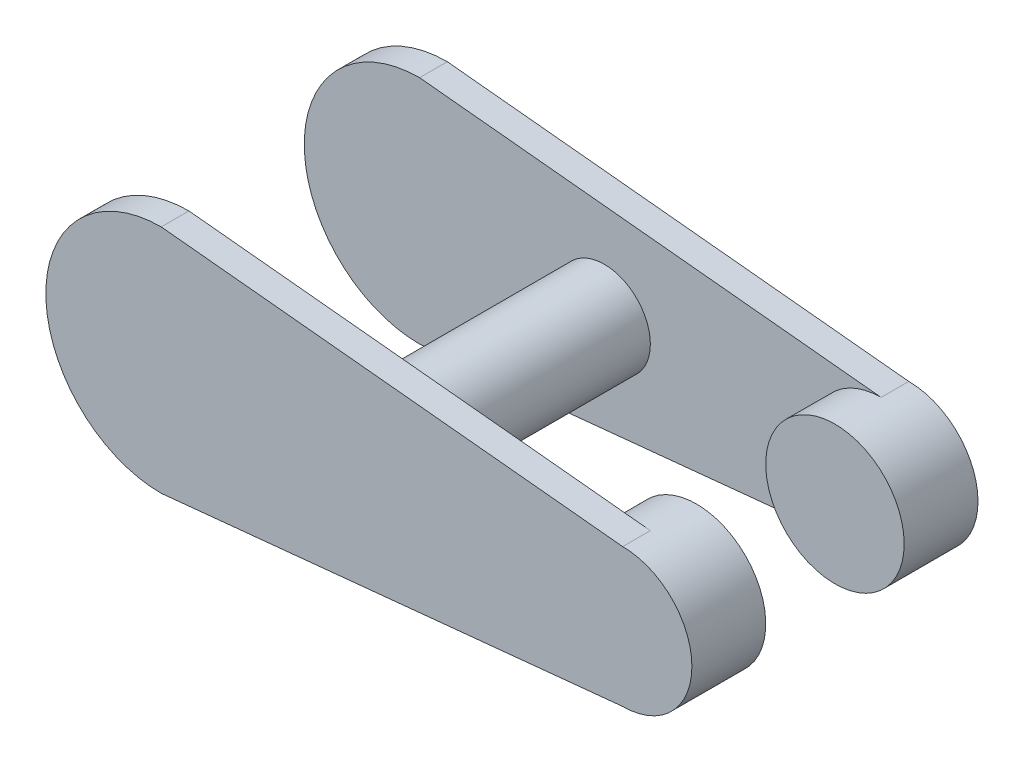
ISO-10303-21;
HEADER;
FILE_DESCRIPTION(('STEP AP214'),'2;1');
FILE_NAME('part.step','',(''),(''),'','','');
FILE_SCHEMA(('AUTOMOTIVE_DESIGN { 1 0 10303 214 1 1 1 1 }'));
ENDSEC;
DATA;
#1=APPLICATION_CONTEXT('core data for automotive mechanical design processes');
#2=APPLICATION_PROTOCOL_DEFINITION('international standard','automotive_design',2000,#1);
#3=PRODUCT_CONTEXT('',#1,'mechanical');
#4=PRODUCT('Part','Part','',(#3));
#5=PRODUCT_RELATED_PRODUCT_CATEGORY('part','',(#4));
#6=PRODUCT_DEFINITION_FORMATION('','',#4);
#7=PRODUCT_DEFINITION_CONTEXT('part definition',#1,'design');
#8=PRODUCT_DEFINITION('design','',#6,#7);
#9=PRODUCT_DEFINITION_SHAPE('','',#8);
#10=(LENGTH_UNIT() NAMED_UNIT(*) SI_UNIT(.MILLI.,.METRE.));
#11=(NAMED_UNIT(*) PLANE_ANGLE_UNIT() SI_UNIT($,.RADIAN.));
#12=(NAMED_UNIT(*) SI_UNIT($,.STERADIAN.) SOLID_ANGLE_UNIT());
#13=UNCERTAINTY_MEASURE_WITH_UNIT(LENGTH_MEASURE(1.E-05),#10,'distance_accuracy_value','');
#14=(GEOMETRIC_REPRESENTATION_CONTEXT(3) GLOBAL_UNCERTAINTY_ASSIGNED_CONTEXT((#13)) GLOBAL_UNIT_ASSIGNED_CONTEXT((#10,
#11,#12)) REPRESENTATION_CONTEXT('',''));
#15=CARTESIAN_POINT('',(0.,0.,0.));
#16=DIRECTION('',(0.,0.,1.));
#17=DIRECTION('',(1.,0.,0.));
#18=AXIS2_PLACEMENT_3D('',#15,#16,#17);
#19=CARTESIAN_POINT('',(1179.73666708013,0.,-125.));
#20=DIRECTION('',(0.,0.,1.));
#21=DIRECTION('',(1.,0.,0.));
#22=AXIS2_PLACEMENT_3D('',#19,#20,#21);
#23=PLANE('',#22);
#24=CARTESIAN_POINT('',(1379.73666708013,0.,-125.));
#25=DIRECTION('',(0.,0.,1.));
#26=DIRECTION('',(1.,0.,0.));
#27=AXIS2_PLACEMENT_3D('',#24,#25,#26);
#28=CIRCLE('',#27,50.);
#29=CARTESIAN_POINT('',(1429.73666708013,0.,-125.));
#30=VERTEX_POINT('',#29);
#31=EDGE_CURVE('E164',#30,#30,#28,.T.);
#32=ORIENTED_EDGE('',*,*,#31,.F.);
#33=EDGE_LOOP('',(#32));
#34=FACE_BOUND('',#33,.T.);
#35=DIRECTION('',(0.995037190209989,0.099503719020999,0.));
#36=VECTOR('',#35,1.);
#37=CARTESIAN_POINT('',(1179.73666708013,-125.,-125.));
#38=LINE('',#37,#36);
#39=CARTESIAN_POINT('',(1179.73666708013,-125.,-125.));
#40=VERTEX_POINT('',#39);
#41=CARTESIAN_POINT('',(1679.73666708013,-75.,-125.));
#42=VERTEX_POINT('',#41);
#43=EDGE_CURVE('E113',#40,#42,#38,.T.);
#44=ORIENTED_EDGE('',*,*,#43,.T.);
#45=CARTESIAN_POINT('',(1679.73666708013,0.,-125.));
#46=DIRECTION('',(0.,0.,1.));
#47=DIRECTION('',(1.,0.,0.));
#48=AXIS2_PLACEMENT_3D('',#45,#46,#47);
#49=CIRCLE('',#48,75.);
#50=CARTESIAN_POINT('',(1679.73666708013,75.,-125.));
#51=VERTEX_POINT('',#50);
#52=EDGE_CURVE('E119',#51,#42,#49,.T.);
#53=ORIENTED_EDGE('',*,*,#52,.F.);
#54=DIRECTION('',(-0.995037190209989,0.099503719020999,0.));
#55=VECTOR('',#54,1.);
#56=CARTESIAN_POINT('',(1179.73666708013,125.,-125.));
#57=LINE('',#56,#55);
#58=CARTESIAN_POINT('',(1179.73666708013,125.,-125.));
#59=VERTEX_POINT('',#58);
#60=EDGE_CURVE('E104',#51,#59,#57,.T.);
#61=ORIENTED_EDGE('',*,*,#60,.T.);
#62=CARTESIAN_POINT('',(1179.73666708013,0.,-125.));
#63=DIRECTION('',(0.,0.,1.));
#64=DIRECTION('',(1.,0.,0.));
#65=AXIS2_PLACEMENT_3D('',#62,#63,#64);
#66=CIRCLE('',#65,125.);
#67=EDGE_CURVE('E167',#59,#40,#66,.T.);
#68=ORIENTED_EDGE('',*,*,#67,.T.);
#69=EDGE_LOOP('',(#44,#53,#61,#68));
#70=FACE_BOUND('',#69,.T.);
#71=ADVANCED_FACE('F37',(#34,#70),#23,.T.);
#72=CARTESIAN_POINT('',(1179.73666708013,0.,125.));
#73=DIRECTION('',(0.,0.,1.));
#74=DIRECTION('',(1.,0.,0.));
#75=AXIS2_PLACEMENT_3D('',#72,#73,#74);
#76=PLANE('',#75);
#77=CARTESIAN_POINT('',(1379.73666708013,0.,125.));
#78=DIRECTION('',(0.,0.,-1.));
#79=DIRECTION('',(-1.,0.,0.));
#80=AXIS2_PLACEMENT_3D('',#77,#78,#79);
#81=CIRCLE('',#80,50.);
#82=CARTESIAN_POINT('',(1329.73666708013,0.,125.));
#83=VERTEX_POINT('',#82);
#84=EDGE_CURVE('E156',#83,#83,#81,.T.);
#85=ORIENTED_EDGE('',*,*,#84,.F.);
#86=EDGE_LOOP('',(#85));
#87=FACE_BOUND('',#86,.T.);
#88=CARTESIAN_POINT('',(1679.73666708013,0.,125.));
#89=DIRECTION('',(0.,0.,1.));
#90=DIRECTION('',(1.,0.,0.));
#91=AXIS2_PLACEMENT_3D('',#88,#89,#90);
#92=CIRCLE('',#91,75.);
#93=CARTESIAN_POINT('',(1679.73666708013,-75.,125.));
#94=VERTEX_POINT('',#93);
#95=CARTESIAN_POINT('',(1679.73666708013,75.,125.));
#96=VERTEX_POINT('',#95);
#97=EDGE_CURVE('E11',#94,#96,#92,.F.);
#98=ORIENTED_EDGE('',*,*,#97,.F.);
#99=DIRECTION('',(0.995037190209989,0.099503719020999,0.));
#100=VECTOR('',#99,1.);
#101=CARTESIAN_POINT('',(1179.73666708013,-125.,125.));
#102=LINE('',#101,#100);
#103=CARTESIAN_POINT('',(1179.73666708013,-125.,125.));
#104=VERTEX_POINT('',#103);
#105=EDGE_CURVE('E136',#104,#94,#102,.T.);
#106=ORIENTED_EDGE('',*,*,#105,.F.);
#107=CARTESIAN_POINT('',(1179.73666708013,0.,125.));
#108=DIRECTION('',(0.,0.,1.));
#109=DIRECTION('',(1.,0.,0.));
#110=AXIS2_PLACEMENT_3D('',#107,#108,#109);
#111=CIRCLE('',#110,125.);
#112=CARTESIAN_POINT('',(1179.73666708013,125.,125.));
#113=VERTEX_POINT('',#112);
#114=EDGE_CURVE('E133',#113,#104,#111,.T.);
#115=ORIENTED_EDGE('',*,*,#114,.F.);
#116=DIRECTION('',(-0.995037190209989,0.099503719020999,0.));
#117=VECTOR('',#116,1.);
#118=CARTESIAN_POINT('',(1179.73666708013,125.,125.));
#119=LINE('',#118,#117);
#120=EDGE_CURVE('E140',#96,#113,#119,.T.);
#121=ORIENTED_EDGE('',*,*,#120,.F.);
#122=EDGE_LOOP('',(#98,#106,#115,#121));
#123=FACE_BOUND('',#122,.T.);
#124=ADVANCED_FACE('F189',(#87,#123),#76,.F.);
#125=CARTESIAN_POINT('',(1179.73666708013,0.,-155.));
#126=DIRECTION('',(0.,0.,1.));
#127=DIRECTION('',(1.,0.,0.));
#128=AXIS2_PLACEMENT_3D('',#125,#126,#127);
#129=CYLINDRICAL_SURFACE('',#128,125.);
#130=ORIENTED_EDGE('',*,*,#67,.F.);
#131=DIRECTION('',(0.,0.,1.));
#132=VECTOR('',#131,1.);
#133=CARTESIAN_POINT('',(1179.73666708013,125.,-155.));
#134=LINE('',#133,#132);
#135=CARTESIAN_POINT('',(1179.73666708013,125.,-155.));
#136=VERTEX_POINT('',#135);
#137=EDGE_CURVE('E46',#136,#59,#134,.T.);
#138=ORIENTED_EDGE('',*,*,#137,.F.);
#139=CARTESIAN_POINT('',(1179.73666708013,0.,-155.));
#140=DIRECTION('',(0.,0.,1.));
#141=DIRECTION('',(1.,0.,0.));
#142=AXIS2_PLACEMENT_3D('',#139,#140,#141);
#143=CIRCLE('',#142,125.);
#144=CARTESIAN_POINT('',(1179.73666708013,-125.,-155.));
#145=VERTEX_POINT('',#144);
#146=EDGE_CURVE('E112',#136,#145,#143,.T.);
#147=ORIENTED_EDGE('',*,*,#146,.T.);
#148=DIRECTION('',(0.,0.,1.));
#149=VECTOR('',#148,1.);
#150=CARTESIAN_POINT('',(1179.73666708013,-125.,-155.));
#151=LINE('',#150,#149);
#152=EDGE_CURVE('E77',#145,#40,#151,.T.);
#153=ORIENTED_EDGE('',*,*,#152,.T.);
#154=EDGE_LOOP('',(#130,#138,#147,#153));
#155=FACE_BOUND('',#154,.T.);
#156=ADVANCED_FACE('F39',(#155),#129,.T.);
#157=CARTESIAN_POINT('',(1179.73666708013,125.,-155.));
#158=DIRECTION('',(0.0995037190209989,0.995037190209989,0.));
#159=DIRECTION('',(-0.995037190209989,0.099503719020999,0.));
#160=AXIS2_PLACEMENT_3D('',#157,#158,#159);
#161=PLANE('',#160);
#162=ORIENTED_EDGE('',*,*,#60,.F.);
#163=DIRECTION('',(0.,0.,1.));
#164=VECTOR('',#163,1.);
#165=CARTESIAN_POINT('',(1679.73666708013,75.,-155.));
#166=LINE('',#165,#164);
#167=CARTESIAN_POINT('',(1679.73666708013,75.,-155.));
#168=VERTEX_POINT('',#167);
#169=EDGE_CURVE('E107',#168,#51,#166,.T.);
#170=ORIENTED_EDGE('',*,*,#169,.F.);
#171=DIRECTION('',(-0.995037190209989,0.099503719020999,0.));
#172=VECTOR('',#171,1.);
#173=CARTESIAN_POINT('',(1179.73666708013,125.,-155.));
#174=LINE('',#173,#172);
#175=EDGE_CURVE('E172',#168,#136,#174,.T.);
#176=ORIENTED_EDGE('',*,*,#175,.T.);
#177=ORIENTED_EDGE('',*,*,#137,.T.);
#178=EDGE_LOOP('',(#162,#170,#176,#177));
#179=FACE_BOUND('',#178,.T.);
#180=ADVANCED_FACE('F106',(#179),#161,.T.);
#181=CARTESIAN_POINT('',(1679.73666708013,0.,-155.));
#182=DIRECTION('',(0.,0.,1.));
#183=DIRECTION('',(1.,0.,0.));
#184=AXIS2_PLACEMENT_3D('',#181,#182,#183);
#185=CYLINDRICAL_SURFACE('',#184,75.);
#186=ORIENTED_EDGE('',*,*,#169,.T.);
#187=ORIENTED_EDGE('',*,*,#52,.T.);
#188=DIRECTION('',(0.,0.,1.));
#189=VECTOR('',#188,1.);
#190=CARTESIAN_POINT('',(1679.73666708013,-75.,-155.));
#191=LINE('',#190,#189);
#192=CARTESIAN_POINT('',(1679.73666708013,-75.,-155.));
#193=VERTEX_POINT('',#192);
#194=EDGE_CURVE('E69',#193,#42,#191,.T.);
#195=ORIENTED_EDGE('',*,*,#194,.F.);
#196=CARTESIAN_POINT('',(1679.73666708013,0.,-155.));
#197=DIRECTION('',(0.,0.,1.));
#198=DIRECTION('',(1.,0.,0.));
#199=AXIS2_PLACEMENT_3D('',#196,#197,#198);
#200=CIRCLE('',#199,75.);
#201=EDGE_CURVE('E121',#193,#168,#200,.T.);
#202=ORIENTED_EDGE('',*,*,#201,.T.);
#203=EDGE_LOOP('',(#186,#187,#195,#202));
#204=FACE_BOUND('',#203,.T.);
#205=CARTESIAN_POINT('',(1679.73666708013,0.,-75.));
#206=DIRECTION('',(0.,0.,1.));
#207=DIRECTION('',(1.,0.,0.));
#208=AXIS2_PLACEMENT_3D('',#205,#206,#207);
#209=CIRCLE('',#208,75.);
#210=CARTESIAN_POINT('',(1754.73666708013,0.,-75.));
#211=VERTEX_POINT('',#210);
#212=EDGE_CURVE('E124',#211,#211,#209,.T.);
#213=ORIENTED_EDGE('',*,*,#212,.F.);
#214=EDGE_LOOP('',(#213));
#215=FACE_BOUND('',#214,.T.);
#216=ADVANCED_FACE('F117',(#204,#215),#185,.T.);
#217=CARTESIAN_POINT('',(1179.73666708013,-125.,-155.));
#218=DIRECTION('',(0.0995037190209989,-0.995037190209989,0.));
#219=DIRECTION('',(0.995037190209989,0.099503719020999,0.));
#220=AXIS2_PLACEMENT_3D('',#217,#218,#219);
#221=PLANE('',#220);
#222=ORIENTED_EDGE('',*,*,#43,.F.);
#223=ORIENTED_EDGE('',*,*,#152,.F.);
#224=DIRECTION('',(0.995037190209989,0.099503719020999,0.));
#225=VECTOR('',#224,1.);
#226=CARTESIAN_POINT('',(1179.73666708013,-125.,-155.));
#227=LINE('',#226,#225);
#228=EDGE_CURVE('E169',#145,#193,#227,.T.);
#229=ORIENTED_EDGE('',*,*,#228,.T.);
#230=ORIENTED_EDGE('',*,*,#194,.T.);
#231=EDGE_LOOP('',(#222,#223,#229,#230));
#232=FACE_BOUND('',#231,.T.);
#233=ADVANCED_FACE('F177',(#232),#221,.T.);
#234=CARTESIAN_POINT('',(1179.73666708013,0.,-155.));
#235=DIRECTION('',(0.,0.,1.));
#236=DIRECTION('',(1.,0.,0.));
#237=AXIS2_PLACEMENT_3D('',#234,#235,#236);
#238=PLANE('',#237);
#239=ORIENTED_EDGE('',*,*,#146,.F.);
#240=ORIENTED_EDGE('',*,*,#175,.F.);
#241=ORIENTED_EDGE('',*,*,#201,.F.);
#242=ORIENTED_EDGE('',*,*,#228,.F.);
#243=EDGE_LOOP('',(#239,#240,#241,#242));
#244=FACE_BOUND('',#243,.T.);
#245=ADVANCED_FACE('F179',(#244),#238,.F.);
#246=CARTESIAN_POINT('',(1379.73666708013,0.,-500000.));
#247=DIRECTION('',(0.,0.,1.));
#248=DIRECTION('',(1.,0.,0.));
#249=AXIS2_PLACEMENT_3D('',#246,#247,#248);
#250=CYLINDRICAL_SURFACE('',#249,50.);
#251=ORIENTED_EDGE('',*,*,#31,.T.);
#252=EDGE_LOOP('',(#251));
#253=FACE_BOUND('',#252,.T.);
#254=ORIENTED_EDGE('',*,*,#84,.T.);
#255=EDGE_LOOP('',(#254));
#256=FACE_BOUND('',#255,.T.);
#257=ADVANCED_FACE('F184',(#253,#256),#250,.T.);
#258=CARTESIAN_POINT('',(1179.73666708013,0.,125.));
#259=DIRECTION('',(0.,0.,1.));
#260=DIRECTION('',(1.,0.,0.));
#261=AXIS2_PLACEMENT_3D('',#258,#259,#260);
#262=CYLINDRICAL_SURFACE('',#261,125.);
#263=CARTESIAN_POINT('',(1179.73666708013,0.,155.));
#264=DIRECTION('',(0.,0.,1.));
#265=DIRECTION('',(1.,0.,0.));
#266=AXIS2_PLACEMENT_3D('',#263,#264,#265);
#267=CIRCLE('',#266,125.);
#268=CARTESIAN_POINT('',(1179.73666708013,125.,155.));
#269=VERTEX_POINT('',#268);
#270=CARTESIAN_POINT('',(1179.73666708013,-125.,155.));
#271=VERTEX_POINT('',#270);
#272=EDGE_CURVE('E132',#269,#271,#267,.T.);
#273=ORIENTED_EDGE('',*,*,#272,.F.);
#274=DIRECTION('',(0.,0.,1.));
#275=VECTOR('',#274,1.);
#276=CARTESIAN_POINT('',(1179.73666708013,125.,125.));
#277=LINE('',#276,#275);
#278=EDGE_CURVE('E154',#113,#269,#277,.T.);
#279=ORIENTED_EDGE('',*,*,#278,.F.);
#280=ORIENTED_EDGE('',*,*,#114,.T.);
#281=DIRECTION('',(0.,0.,1.));
#282=VECTOR('',#281,1.);
#283=CARTESIAN_POINT('',(1179.73666708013,-125.,125.));
#284=LINE('',#283,#282);
#285=EDGE_CURVE('E143',#104,#271,#284,.T.);
#286=ORIENTED_EDGE('',*,*,#285,.T.);
#287=EDGE_LOOP('',(#273,#279,#280,#286));
#288=FACE_BOUND('',#287,.T.);
#289=ADVANCED_FACE('F229',(#288),#262,.T.);
#290=CARTESIAN_POINT('',(1179.73666708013,125.,125.));
#291=DIRECTION('',(0.0995037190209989,0.995037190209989,0.));
#292=DIRECTION('',(-0.995037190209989,0.099503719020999,0.));
#293=AXIS2_PLACEMENT_3D('',#290,#291,#292);
#294=PLANE('',#293);
#295=DIRECTION('',(-0.995037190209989,0.099503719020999,0.));
#296=VECTOR('',#295,1.);
#297=CARTESIAN_POINT('',(1179.73666708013,125.,155.));
#298=LINE('',#297,#296);
#299=CARTESIAN_POINT('',(1679.73666708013,75.,155.));
#300=VERTEX_POINT('',#299);
#301=EDGE_CURVE('E137',#300,#269,#298,.T.);
#302=ORIENTED_EDGE('',*,*,#301,.F.);
#303=DIRECTION('',(0.,0.,1.));
#304=VECTOR('',#303,1.);
#305=CARTESIAN_POINT('',(1679.73666708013,75.,125.));
#306=LINE('',#305,#304);
#307=EDGE_CURVE('E157',#96,#300,#306,.T.);
#308=ORIENTED_EDGE('',*,*,#307,.F.);
#309=ORIENTED_EDGE('',*,*,#120,.T.);
#310=ORIENTED_EDGE('',*,*,#278,.T.);
#311=EDGE_LOOP('',(#302,#308,#309,#310));
#312=FACE_BOUND('',#311,.T.);
#313=ADVANCED_FACE('F223',(#312),#294,.T.);
#314=CARTESIAN_POINT('',(1679.73666708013,0.,125.));
#315=DIRECTION('',(0.,0.,1.));
#316=DIRECTION('',(1.,0.,0.));
#317=AXIS2_PLACEMENT_3D('',#314,#315,#316);
#318=CYLINDRICAL_SURFACE('',#317,75.);
#319=CARTESIAN_POINT('',(1679.73666708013,0.,155.));
#320=DIRECTION('',(0.,0.,1.));
#321=DIRECTION('',(1.,0.,0.));
#322=AXIS2_PLACEMENT_3D('',#319,#320,#321);
#323=CIRCLE('',#322,75.);
#324=CARTESIAN_POINT('',(1679.73666708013,-75.,155.));
#325=VERTEX_POINT('',#324);
#326=EDGE_CURVE('E149',#325,#300,#323,.T.);
#327=ORIENTED_EDGE('',*,*,#326,.F.);
#328=DIRECTION('',(0.,0.,1.));
#329=VECTOR('',#328,1.);
#330=CARTESIAN_POINT('',(1679.73666708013,-75.,125.));
#331=LINE('',#330,#329);
#332=EDGE_CURVE('E159',#94,#325,#331,.T.);
#333=ORIENTED_EDGE('',*,*,#332,.F.);
#334=ORIENTED_EDGE('',*,*,#97,.T.);
#335=ORIENTED_EDGE('',*,*,#307,.T.);
#336=EDGE_LOOP('',(#327,#333,#334,#335));
#337=FACE_BOUND('',#336,.T.);
#338=CARTESIAN_POINT('',(1679.73666708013,0.,75.));
#339=DIRECTION('',(0.,0.,-1.));
#340=DIRECTION('',(-1.,0.,0.));
#341=AXIS2_PLACEMENT_3D('',#338,#339,#340);
#342=CIRCLE('',#341,75.);
#343=CARTESIAN_POINT('',(1604.73666708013,0.,75.));
#344=VERTEX_POINT('',#343);
#345=EDGE_CURVE('E127',#344,#344,#342,.T.);
#346=ORIENTED_EDGE('',*,*,#345,.F.);
#347=EDGE_LOOP('',(#346));
#348=FACE_BOUND('',#347,.T.);
#349=ADVANCED_FACE('F228',(#337,#348),#318,.T.);
#350=CARTESIAN_POINT('',(1179.73666708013,-125.,125.));
#351=DIRECTION('',(0.0995037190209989,-0.995037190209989,0.));
#352=DIRECTION('',(0.995037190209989,0.099503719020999,0.));
#353=AXIS2_PLACEMENT_3D('',#350,#351,#352);
#354=PLANE('',#353);
#355=DIRECTION('',(0.995037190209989,0.099503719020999,0.));
#356=VECTOR('',#355,1.);
#357=CARTESIAN_POINT('',(1179.73666708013,-125.,155.));
#358=LINE('',#357,#356);
#359=EDGE_CURVE('E146',#271,#325,#358,.T.);
#360=ORIENTED_EDGE('',*,*,#359,.F.);
#361=ORIENTED_EDGE('',*,*,#285,.F.);
#362=ORIENTED_EDGE('',*,*,#105,.T.);
#363=ORIENTED_EDGE('',*,*,#332,.T.);
#364=EDGE_LOOP('',(#360,#361,#362,#363));
#365=FACE_BOUND('',#364,.T.);
#366=ADVANCED_FACE('F241',(#365),#354,.T.);
#367=CARTESIAN_POINT('',(1179.73666708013,0.,155.));
#368=DIRECTION('',(0.,0.,1.));
#369=DIRECTION('',(1.,0.,0.));
#370=AXIS2_PLACEMENT_3D('',#367,#368,#369);
#371=PLANE('',#370);
#372=ORIENTED_EDGE('',*,*,#272,.T.);
#373=ORIENTED_EDGE('',*,*,#359,.T.);
#374=ORIENTED_EDGE('',*,*,#326,.T.);
#375=ORIENTED_EDGE('',*,*,#301,.T.);
#376=EDGE_LOOP('',(#372,#373,#374,#375));
#377=FACE_BOUND('',#376,.T.);
#378=ADVANCED_FACE('F218',(#377),#371,.T.);
#379=CARTESIAN_POINT('',(1679.73666708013,0.,75.));
#380=DIRECTION('',(0.,0.,-1.));
#381=DIRECTION('',(-1.,0.,0.));
#382=AXIS2_PLACEMENT_3D('',#379,#380,#381);
#383=PLANE('',#382);
#384=ORIENTED_EDGE('',*,*,#345,.T.);
#385=EDGE_LOOP('',(#384));
#386=FACE_BOUND('',#385,.T.);
#387=ADVANCED_FACE('F257',(#386),#383,.T.);
#388=CARTESIAN_POINT('',(1679.73666708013,0.,-75.));
#389=DIRECTION('',(0.,0.,1.));
#390=DIRECTION('',(1.,0.,0.));
#391=AXIS2_PLACEMENT_3D('',#388,#389,#390);
#392=PLANE('',#391);
#393=ORIENTED_EDGE('',*,*,#212,.T.);
#394=EDGE_LOOP('',(#393));
#395=FACE_BOUND('',#394,.T.);
#396=ADVANCED_FACE('F260',(#395),#392,.T.);
#397=CLOSED_SHELL('',(#71,#124,#156,#180,#216,#233,#245,#257,#289,#313,#349,#366,#378,#387,#396));
#398=MANIFOLD_SOLID_BREP('B2',#397);
#399=ADVANCED_BREP_SHAPE_REPRESENTATION('',(#18,#398),#14);
#400=SHAPE_DEFINITION_REPRESENTATION(#9,#399);
ENDSEC;
END-ISO-10303-21;
